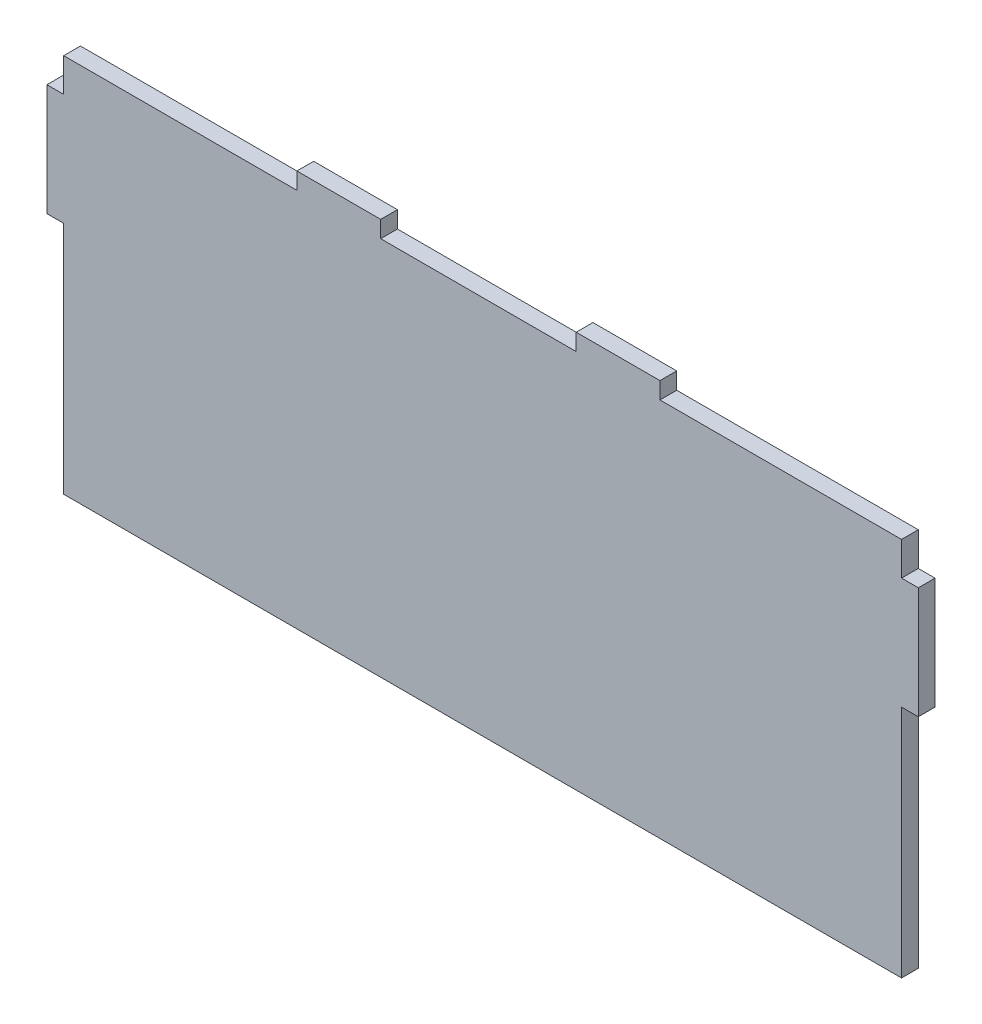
from build123d import *

# Parameters (mm, degrees)
SALIENTE_EXTRUIR1_DEPTH = 15


with BuildPart() as part:
    # Croquis1 → Saliente-Extruir1 (new body)
    with BuildSketch(Plane.XY):
        Polygon((-166.25, 152.5), (-166.25, 167.5), (-91.25, 167.5), (-91.25, 152.5), (83.75, 152.5), (83.75, 167.5), (158.75, 167.5), (158.75, 152.5), (375, 152.5), (375, 122.5), (390, 122.5), (390, 22.5), (375, 22.5), (375, -187.5), (-375, -187.5), (-375, 22.5), (-390, 22.5), (-390, 122.5), (-375, 122.5), (-375, 152.5), align=None)
    extrude(amount=SALIENTE_EXTRUIR1_DEPTH)


solid = part.part
